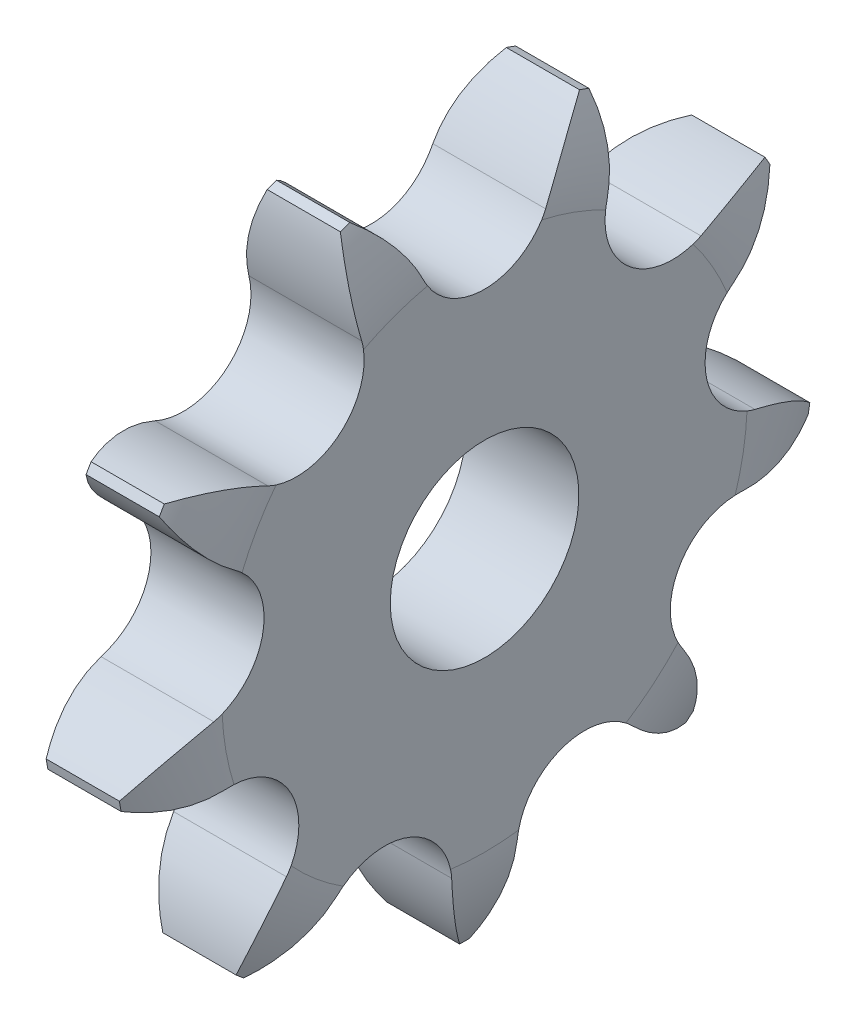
from build123d import *

# Parameters (mm, degrees)
TOOTHCUT_DEPTH  = 33.277632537
TEETHCUTS_COUNT = 9
TEETHCUTS_ANGLE = 320
BORSKE_R        = 6
BORE_DEPTH      = 9.4005


with BuildPart() as part:
    # BasProSke → Base-Revolve (revolve)
    with BuildSketch(Plane(origin=(0, 0, 0), x_dir=(1, 0, 0), z_dir=(0, 1, 0)), mode=Mode.PRIVATE) as base_revolve_sk:
        with BuildLine():
            Line((0, 0), (0, 16.712856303))
            ThreePointArc((0, 16.712856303), (0.321571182, 19.552662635), (1.27, 22.248657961))
            Line((1.27, 22.248657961), (5.93, 22.248657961))
            ThreePointArc((5.93, 22.248657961), (6.878428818, 19.552662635), (7.2, 16.712856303))
            Line((7.2, 16.712856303), (7.2, 0))
            Line((7.2, 0), (0, 0))
        make_face()
    revolve(base_revolve_sk.sketch.rotate(Axis((-10, 0, 0), (1, 0, 0)), 180), axis=Axis((-10, 0, 0), (1, 0, 0)))

    # TooCutSke → ToothCut (cut, through all)
    with BuildSketch(Plane(origin=(0, 0, 0), x_dir=(0, 0, -1), z_dir=(1, 0, 0))):
        with BuildLine():
            ThreePointArc((3.89490303, 16.792484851), (5.53909395, 19.346647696), (7.807509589, 21.366895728))
            ThreePointArc((7.807509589, 21.366895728), (0, 22.748657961), (-7.807509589, 21.366895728))
            ThreePointArc((-7.807509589, 21.366895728), (-5.53909395, 19.346647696), (-3.89490303, 16.792484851))
            ThreePointArc((-3.89490303, 16.792484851), (0, 14.311157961), (3.89490303, 16.792484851))
        make_face()
    toothcut = extrude(amount=TOOTHCUT_DEPTH, mode=Mode.SUBTRACT)

    # TeethCuts: ToothCut ×9 about axis
    teethcuts_axis = Axis((-10, 0, 0), (1, 0, 0))
    for i in range(1, TEETHCUTS_COUNT):
        add(toothcut.rotate(teethcuts_axis, i * TEETHCUTS_ANGLE / (TEETHCUTS_COUNT - 1)), mode=Mode.SUBTRACT)

    # BorSke → Bore (cut, symmetric)
    with BuildSketch(Plane(origin=(0, 0, 0), x_dir=(0, 0, -1), z_dir=(1, 0, 0))):
        with Locations(Location((0, 0, 0), (0, 0, 180))):
            Circle(BORSKE_R)
    extrude(amount=BORE_DEPTH, both=True, mode=Mode.SUBTRACT)


solid = part.part
